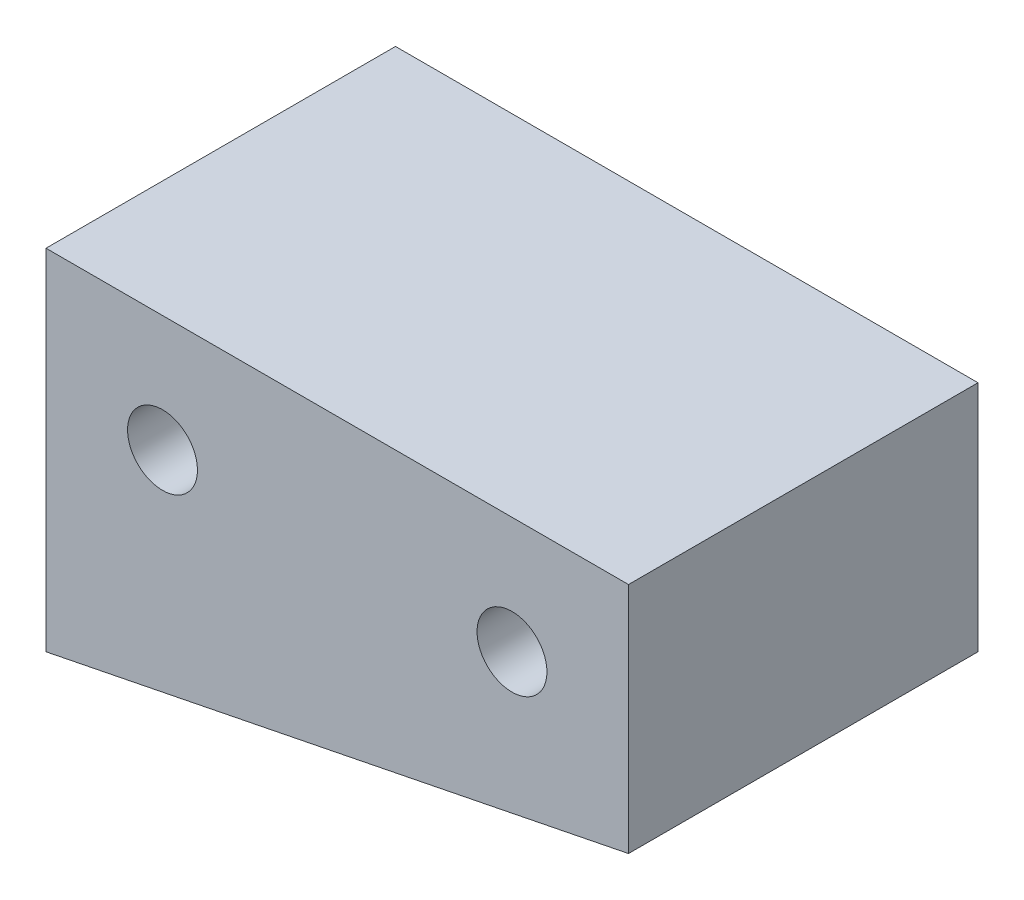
from build123d import *

# Parameters (mm, degrees)
ESQUISSE1_W             = 25
ESQUISSE1_H             = 15
EXTRUSION1_DEPTH        = 15
ENL_V_MAT_EXTRU_1_DEPTH = 33.787192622
ESQUISSE4_R             = 1.5
ENL_V_MAT_EXTRU_2_DEPTH = 33.787192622
CHANFREIN2_SIZE         = 1.5


with BuildPart() as part:
    # Esquisse1 → Extrusion1 (new body)
    with BuildSketch(Plane.XY):
        with Locations((12.5, 7.5)):
            Rectangle(ESQUISSE1_W, ESQUISSE1_H)
    extrude(amount=EXTRUSION1_DEPTH)

    # Esquisse3 → Enl_v. mat.-Extru.1 (cut, through all)
    with BuildSketch(Plane.XY.offset(15)):
        Polygon((0, 0), (27.668023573, 5.533638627), (31.326774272, -4.289134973), (-9.596340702, -10.770373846), align=None)
    extrude(amount=-ENL_V_MAT_EXTRU_1_DEPTH, mode=Mode.SUBTRACT)

    # Esquisse4 → Enl_v. mat.-Extru.2 (cut, through all)
    with BuildSketch(Plane.XY.offset(15)):
        with Locations((20, 10.000015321)):
            Circle(ESQUISSE4_R)
        with Locations((5, 10.000015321)):
            Circle(ESQUISSE4_R)
    extrude(amount=-ENL_V_MAT_EXTRU_2_DEPTH, mode=Mode.SUBTRACT)

    # Chanfrein2
    chanfrein2_edges = [part.edges().sort_by_distance(p)[0] for p in [
        (18.5, 10.000015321, 0),
        (3.5, 10.000015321, 0),
    ]]
    chamfer(chanfrein2_edges, length=CHANFREIN2_SIZE)


solid = part.part
